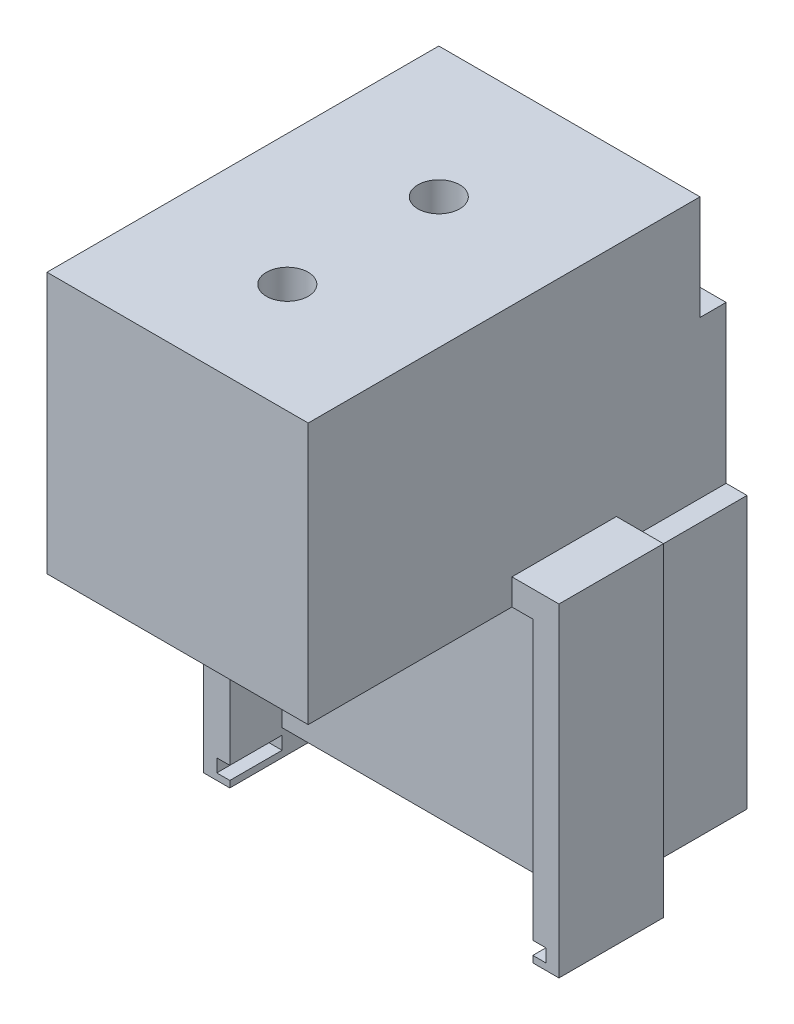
from build123d import *

# Parameters (mm, degrees)
SKETCH1_W                 = 50
SKETCH1_H                 = 80
SKETCH1_R                 = 4
BOSS_EXTRUDE1_DEPTH       = 50
BOSS_EXTRUDE2_START       = -40
SKETCH1_3_R               = 4
BOSS_EXTRUDE2_DEPTH       = 40
SKETCH2_W                 = 5
SKETCH2_H                 = 20
CUT_EXTRUDE2_DEPTH        = 107.77078252
SKETCH1_4_R               = 4
BOSS_EXTRUDE4_DEPTH       = 10
SKETCH1_5_R               = 4
CUT_EXTRUDE4_DEPTH        = 107.77078252
BOSS_EXTRUDE5_DEPTH       = 29
BOSS_EXTRUDE5_DEPTH_BACK  = 29
BOSS_EXTRUDE5_START       = -25
SKETCH3_W                 = 31
SKETCH3_H                 = 52
SKETCH8_R                 = 7.5
CUT_EXTRUDE5_DEPTH        = 25
BOSS_EXTRUDE12_DEPTH      = 10
BOSS_EXTRUDE12_DEPTH_BACK = 10
SKETCH12_W                = 2.5
SKETCH12_H                = 2.5
BOSS_EXTRUDE13_DEPTH      = 10


with BuildPart() as part:
    # Sketch1 → Boss-Extrude1 (new body)
    with BuildSketch(Plane(origin=(0, 0, 0), x_dir=(1, 0, 0), z_dir=(0, 1, 0))):
        with Locations((25, 40)):
            Rectangle(SKETCH1_W, SKETCH1_H)
        with Locations(Location((25, 50, 0), (0, 0, 270))):
            Circle(SKETCH1_R, mode=Mode.SUBTRACT)
        with Locations(Location((25, 21, 0), (0, 0, 270))):
            Circle(SKETCH1_R, mode=Mode.SUBTRACT)
    extrude(amount=BOSS_EXTRUDE1_DEPTH)

    # Sketch1_3 → Boss-Extrude2 (add)
    with BuildSketch(Plane(origin=(0, 0, 0), x_dir=(1, 0, 0), z_dir=(0, 1, 0)).offset(BOSS_EXTRUDE2_START)):
        with Locations(Location((25, 21, 0), (0, 0, 270))):
            Circle(SKETCH1_3_R)
    extrude(amount=BOSS_EXTRUDE2_DEPTH)


with BuildPart() as boss_extrude2_kept_piece:
    # of the separate pieces the step leaves, the one the design keeps (boss_extrude2_pieces_kept)
    add(part.part.solids().sort_by_distance((0, 0, -80))[0])

    # Sketch2 → Cut-Extrude2 (cut, through all)
    with BuildSketch(Plane.ZY):
        with Locations((-77.5, 40)):
            Rectangle(SKETCH2_W, SKETCH2_H)
    extrude(amount=-CUT_EXTRUDE2_DEPTH, mode=Mode.SUBTRACT)

    # Sketch1_4 → Boss-Extrude4 (add)
    with BuildSketch(Plane(origin=(0, 0, 0), x_dir=(1, 0, 0), z_dir=(0, 1, 0))):
        with Locations(Location((25, 21, 0), (0, 0, 270))):
            Circle(SKETCH1_4_R)
        with Locations(Location((25, 50, 0), (0, 0, 270))):
            Circle(SKETCH1_4_R)
    extrude(amount=BOSS_EXTRUDE4_DEPTH)

    # Sketch1_5 → Cut-Extrude4 (cut, through all)
    with BuildSketch(Plane(origin=(0, 0, 0), x_dir=(1, 0, 0), z_dir=(0, 1, 0))):
        with Locations(Location((25, 21, 0), (0, 0, 270))):
            Circle(SKETCH1_5_R)
    extrude(amount=CUT_EXTRUDE4_DEPTH, mode=Mode.SUBTRACT)

    # Sketch3 → Boss-Extrude5 (add, two sides: drawn at the far end of the back side and taken through both)
    with BuildSketch(Plane(origin=(50, 0, 0), x_dir=(0, 0, -1), z_dir=(1, 0, 0)).offset(BOSS_EXTRUDE5_START - BOSS_EXTRUDE5_DEPTH_BACK)):
        with Locations((64.5, -26)):
            Rectangle(SKETCH3_W, SKETCH3_H)
    extrude(amount=BOSS_EXTRUDE5_DEPTH + BOSS_EXTRUDE5_DEPTH_BACK)

    # Sketch8 → Cut-Extrude5 (cut)
    with BuildSketch(Plane.XZ):
        with Locations(Location((25, -21, 0), (0, 0, 270))):
            Circle(SKETCH8_R)
    extrude(amount=-CUT_EXTRUDE5_DEPTH, mode=Mode.SUBTRACT)

    # Sketch11 → Boss-Extrude12 (add, two sides: drawn at the far end of the back side and taken through both)
    with BuildSketch(Plane.XY.offset(-49).offset(-BOSS_EXTRUDE12_DEPTH_BACK)):
        Polygon((50, 5), (50, 0), (54, 0), (54, -53.250080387), (56.5, -53.250080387), (56.5, -55.750080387), (53.999678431, -55.750080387), (53.999678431, -57), (59, -57), (59, 5), align=None)
        Polygon((-9, -57), (-4, -57), (-4, -55.75), (-6.5, -55.75), (-6.5, -53.25), (-4, -53.25), (-4, 0), (0, 0), (0, 5), (-9, 5), align=None)
    extrude(amount=BOSS_EXTRUDE12_DEPTH + BOSS_EXTRUDE12_DEPTH_BACK)

    # Sketch12 → Boss-Extrude13 (add)
    with BuildSketch(Plane.XY.offset(-49)):
        with Locations((-5.25, -54.5)):
            Rectangle(SKETCH12_W, SKETCH12_H)
        with Locations((55.25, -54.500080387)):
            Rectangle(SKETCH12_W, SKETCH12_H)
    extrude(amount=-BOSS_EXTRUDE13_DEPTH)


solid = boss_extrude2_kept_piece.part
